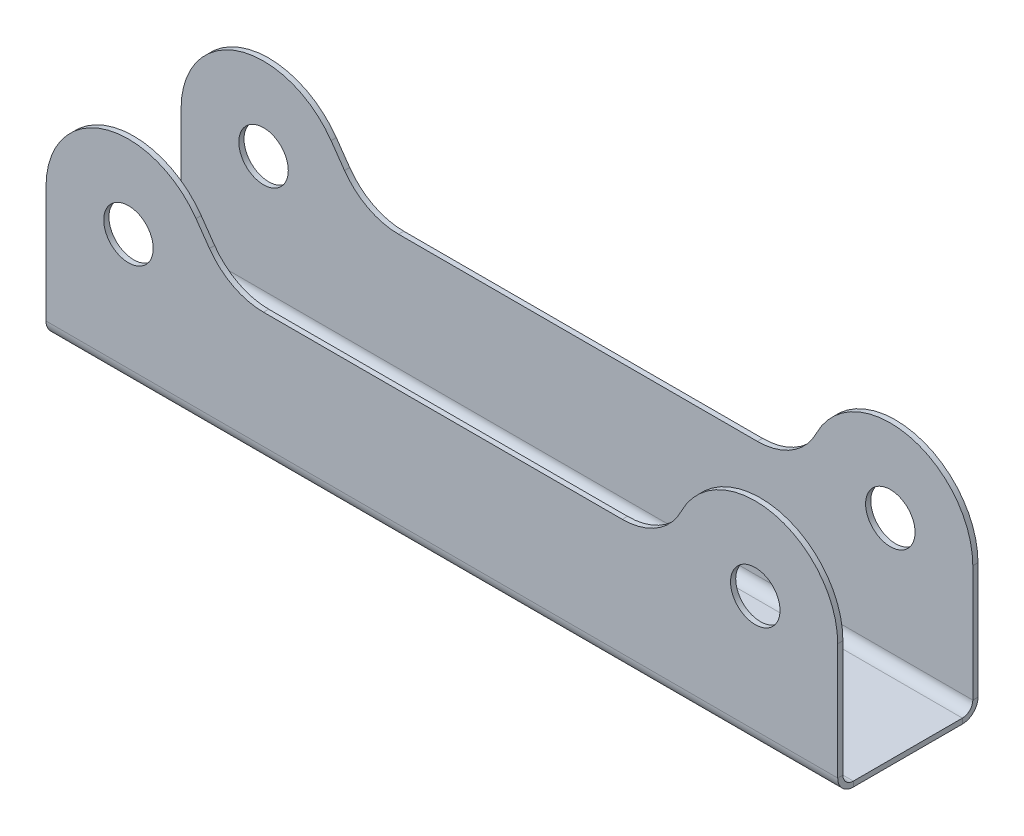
ISO-10303-21;
HEADER;
FILE_DESCRIPTION(('STEP AP214'),'2;1');
FILE_NAME('part.step','',(''),(''),'','','');
FILE_SCHEMA(('AUTOMOTIVE_DESIGN { 1 0 10303 214 1 1 1 1 }'));
ENDSEC;
DATA;
#1=APPLICATION_CONTEXT('core data for automotive mechanical design processes');
#2=APPLICATION_PROTOCOL_DEFINITION('international standard','automotive_design',2000,#1);
#3=PRODUCT_CONTEXT('',#1,'mechanical');
#4=PRODUCT('Part','Part','',(#3));
#5=PRODUCT_RELATED_PRODUCT_CATEGORY('part','',(#4));
#6=PRODUCT_DEFINITION_FORMATION('','',#4);
#7=PRODUCT_DEFINITION_CONTEXT('part definition',#1,'design');
#8=PRODUCT_DEFINITION('design','',#6,#7);
#9=PRODUCT_DEFINITION_SHAPE('','',#8);
#10=(LENGTH_UNIT() NAMED_UNIT(*) SI_UNIT(.MILLI.,.METRE.));
#11=(NAMED_UNIT(*) PLANE_ANGLE_UNIT() SI_UNIT($,.RADIAN.));
#12=(NAMED_UNIT(*) SI_UNIT($,.STERADIAN.) SOLID_ANGLE_UNIT());
#13=UNCERTAINTY_MEASURE_WITH_UNIT(LENGTH_MEASURE(1.E-05),#10,'distance_accuracy_value','');
#14=(GEOMETRIC_REPRESENTATION_CONTEXT(3) GLOBAL_UNCERTAINTY_ASSIGNED_CONTEXT((#13)) GLOBAL_UNIT_ASSIGNED_CONTEXT((#10,
#11,#12)) REPRESENTATION_CONTEXT('',''));
#15=CARTESIAN_POINT('',(0.,0.,0.));
#16=DIRECTION('',(0.,0.,1.));
#17=DIRECTION('',(1.,0.,0.));
#18=AXIS2_PLACEMENT_3D('',#15,#16,#17);
#19=CARTESIAN_POINT('',(120.65,0.,-13.5));
#20=DIRECTION('',(0.,0.,1.));
#21=DIRECTION('',(1.,0.,0.));
#22=AXIS2_PLACEMENT_3D('',#19,#20,#21);
#23=CYLINDRICAL_SURFACE('',#22,4.76250000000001);
#24=CARTESIAN_POINT('',(120.65,0.,-13.5));
#25=DIRECTION('',(0.,0.,1.));
#26=DIRECTION('',(1.,0.,0.));
#27=AXIS2_PLACEMENT_3D('',#24,#25,#26);
#28=CIRCLE('',#27,4.76250000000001);
#29=CARTESIAN_POINT('',(125.4125,0.,-13.5));
#30=VERTEX_POINT('',#29);
#31=EDGE_CURVE('E228',#30,#30,#28,.T.);
#32=ORIENTED_EDGE('',*,*,#31,.F.);
#33=EDGE_LOOP('',(#32));
#34=FACE_BOUND('',#33,.T.);
#35=CARTESIAN_POINT('',(120.65,0.,-12.5));
#36=DIRECTION('',(0.,0.,-1.));
#37=DIRECTION('',(-1.,0.,0.));
#38=AXIS2_PLACEMENT_3D('',#35,#36,#37);
#39=CIRCLE('',#38,4.76250000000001);
#40=CARTESIAN_POINT('',(115.8875,0.,-12.5));
#41=VERTEX_POINT('',#40);
#42=EDGE_CURVE('E292',#41,#41,#39,.T.);
#43=ORIENTED_EDGE('',*,*,#42,.F.);
#44=EDGE_LOOP('',(#43));
#45=FACE_BOUND('',#44,.T.);
#46=ADVANCED_FACE('F28',(#34,#45),#23,.F.);
#47=CARTESIAN_POINT('',(0.,0.,-13.5));
#48=DIRECTION('',(0.,0.,-1.));
#49=DIRECTION('',(-1.,0.,0.));
#50=AXIS2_PLACEMENT_3D('',#47,#48,#49);
#51=PLANE('',#50);
#52=DIRECTION('',(1.,0.,0.));
#53=VECTOR('',#52,1.);
#54=CARTESIAN_POINT('',(136.525,-22.4,-13.5));
#55=LINE('',#54,#53);
#56=CARTESIAN_POINT('',(-15.875,-22.4,-13.5));
#57=VERTEX_POINT('',#56);
#58=CARTESIAN_POINT('',(136.525,-22.4,-13.5));
#59=VERTEX_POINT('',#58);
#60=EDGE_CURVE('E204',#57,#59,#55,.T.);
#61=ORIENTED_EDGE('',*,*,#60,.F.);
#62=DIRECTION('',(0.,-1.,0.));
#63=VECTOR('',#62,1.);
#64=CARTESIAN_POINT('',(-15.875,0.,-13.5));
#65=LINE('',#64,#63);
#66=CARTESIAN_POINT('',(-15.875,0.,-13.5));
#67=VERTEX_POINT('',#66);
#68=EDGE_CURVE('E205',#67,#57,#65,.T.);
#69=ORIENTED_EDGE('',*,*,#68,.F.);
#70=CARTESIAN_POINT('',(0.,0.,-13.5));
#71=DIRECTION('',(0.,0.,-1.));
#72=DIRECTION('',(-1.,0.,0.));
#73=AXIS2_PLACEMENT_3D('',#70,#71,#72);
#74=CIRCLE('',#73,15.875);
#75=CARTESIAN_POINT('',(13.0040387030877,9.10552592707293,-13.5));
#76=VERTEX_POINT('',#75);
#77=EDGE_CURVE('E231',#67,#76,#74,.T.);
#78=ORIENTED_EDGE('',*,*,#77,.T.);
#79=DIRECTION('',(0.57357643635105,-0.819152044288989,0.));
#80=VECTOR('',#79,1.);
#81=CARTESIAN_POINT('',(13.0040387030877,9.10552592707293,-13.5));
#82=LINE('',#81,#80);
#83=CARTESIAN_POINT('',(15.5877671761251,5.41557925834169,-13.5));
#84=VERTEX_POINT('',#83);
#85=EDGE_CURVE('E234',#76,#84,#82,.T.);
#86=ORIENTED_EDGE('',*,*,#85,.T.);
#87=CARTESIAN_POINT('',(25.9909981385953,12.7,-13.5));
#88=DIRECTION('',(0.,0.,-1.));
#89=DIRECTION('',(-1.,0.,0.));
#90=AXIS2_PLACEMENT_3D('',#87,#88,#89);
#91=CIRCLE('',#90,12.7);
#92=CARTESIAN_POINT('',(25.9909981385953,0.,-13.5));
#93=VERTEX_POINT('',#92);
#94=EDGE_CURVE('E237',#84,#93,#91,.F.);
#95=ORIENTED_EDGE('',*,*,#94,.T.);
#96=DIRECTION('',(-1.,0.,0.));
#97=VECTOR('',#96,1.);
#98=CARTESIAN_POINT('',(103.756177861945,0.,-13.5));
#99=LINE('',#98,#97);
#100=CARTESIAN_POINT('',(95.0523316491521,0.,-13.5));
#101=VERTEX_POINT('',#100);
#102=EDGE_CURVE('E240',#101,#93,#99,.T.);
#103=ORIENTED_EDGE('',*,*,#102,.F.);
#104=CARTESIAN_POINT('',(95.0523316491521,12.7,-13.5));
#105=DIRECTION('',(0.,0.,-1.));
#106=DIRECTION('',(-1.,0.,0.));
#107=AXIS2_PLACEMENT_3D('',#104,#105,#106);
#108=CIRCLE('',#107,12.7);
#109=CARTESIAN_POINT('',(106.429073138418,7.05555555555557,-13.5));
#110=VERTEX_POINT('',#109);
#111=EDGE_CURVE('E242',#101,#110,#108,.F.);
#112=ORIENTED_EDGE('',*,*,#111,.T.);
#113=CARTESIAN_POINT('',(120.65,0.,-13.5));
#114=DIRECTION('',(0.,0.,1.));
#115=DIRECTION('',(1.,0.,0.));
#116=AXIS2_PLACEMENT_3D('',#113,#114,#115);
#117=CIRCLE('',#116,15.875);
#118=CARTESIAN_POINT('',(136.525,0.,-13.5));
#119=VERTEX_POINT('',#118);
#120=EDGE_CURVE('E49',#119,#110,#117,.T.);
#121=ORIENTED_EDGE('',*,*,#120,.F.);
#122=DIRECTION('',(0.,1.,0.));
#123=VECTOR('',#122,1.);
#124=CARTESIAN_POINT('',(136.525,-25.4,-13.5));
#125=LINE('',#124,#123);
#126=EDGE_CURVE('E42',#59,#119,#125,.T.);
#127=ORIENTED_EDGE('',*,*,#126,.F.);
#128=EDGE_LOOP('',(#61,#69,#78,#86,#95,#103,#112,#121,#127));
#129=FACE_BOUND('',#128,.T.);
#130=CARTESIAN_POINT('',(0.,0.,-13.5));
#131=DIRECTION('',(0.,0.,1.));
#132=DIRECTION('',(1.,0.,0.));
#133=AXIS2_PLACEMENT_3D('',#130,#131,#132);
#134=CIRCLE('',#133,4.7625);
#135=CARTESIAN_POINT('',(4.7625,0.,-13.5));
#136=VERTEX_POINT('',#135);
#137=EDGE_CURVE('E225',#136,#136,#134,.T.);
#138=ORIENTED_EDGE('',*,*,#137,.T.);
#139=EDGE_LOOP('',(#138));
#140=FACE_BOUND('',#139,.T.);
#141=ORIENTED_EDGE('',*,*,#31,.T.);
#142=EDGE_LOOP('',(#141));
#143=FACE_BOUND('',#142,.T.);
#144=ADVANCED_FACE('F270',(#129,#140,#143),#51,.T.);
#145=CARTESIAN_POINT('',(0.,0.,-13.5));
#146=DIRECTION('',(0.,0.,1.));
#147=DIRECTION('',(1.,0.,0.));
#148=AXIS2_PLACEMENT_3D('',#145,#146,#147);
#149=CYLINDRICAL_SURFACE('',#148,4.7625);
#150=ORIENTED_EDGE('',*,*,#137,.F.);
#151=EDGE_LOOP('',(#150));
#152=FACE_BOUND('',#151,.T.);
#153=CARTESIAN_POINT('',(0.,0.,-12.5));
#154=DIRECTION('',(0.,0.,-1.));
#155=DIRECTION('',(-1.,0.,0.));
#156=AXIS2_PLACEMENT_3D('',#153,#154,#155);
#157=CIRCLE('',#156,4.7625);
#158=CARTESIAN_POINT('',(-4.7625,0.,-12.5));
#159=VERTEX_POINT('',#158);
#160=EDGE_CURVE('E294',#159,#159,#157,.T.);
#161=ORIENTED_EDGE('',*,*,#160,.F.);
#162=EDGE_LOOP('',(#161));
#163=FACE_BOUND('',#162,.T.);
#164=ADVANCED_FACE('F510',(#152,#163),#149,.F.);
#165=CARTESIAN_POINT('',(0.,0.,-12.5));
#166=DIRECTION('',(0.,0.,-1.));
#167=DIRECTION('',(-1.,0.,0.));
#168=AXIS2_PLACEMENT_3D('',#165,#166,#167);
#169=PLANE('',#168);
#170=ORIENTED_EDGE('',*,*,#160,.T.);
#171=EDGE_LOOP('',(#170));
#172=FACE_BOUND('',#171,.T.);
#173=ORIENTED_EDGE('',*,*,#42,.T.);
#174=EDGE_LOOP('',(#173));
#175=FACE_BOUND('',#174,.T.);
#176=DIRECTION('',(0.,-1.,0.));
#177=VECTOR('',#176,1.);
#178=CARTESIAN_POINT('',(-15.875,0.,-12.5));
#179=LINE('',#178,#177);
#180=CARTESIAN_POINT('',(-15.875,0.,-12.5));
#181=VERTEX_POINT('',#180);
#182=CARTESIAN_POINT('',(-15.875,-22.4,-12.5));
#183=VERTEX_POINT('',#182);
#184=EDGE_CURVE('E202',#181,#183,#179,.T.);
#185=ORIENTED_EDGE('',*,*,#184,.T.);
#186=DIRECTION('',(1.,0.,0.));
#187=VECTOR('',#186,1.);
#188=CARTESIAN_POINT('',(136.525,-22.4,-12.5));
#189=LINE('',#188,#187);
#190=CARTESIAN_POINT('',(136.525,-22.4,-12.5));
#191=VERTEX_POINT('',#190);
#192=EDGE_CURVE('E189',#183,#191,#189,.T.);
#193=ORIENTED_EDGE('',*,*,#192,.T.);
#194=DIRECTION('',(0.,1.,0.));
#195=VECTOR('',#194,1.);
#196=CARTESIAN_POINT('',(136.525,0.,-12.5));
#197=LINE('',#196,#195);
#198=CARTESIAN_POINT('',(136.525,0.,-12.5));
#199=VERTEX_POINT('',#198);
#200=EDGE_CURVE('E199',#191,#199,#197,.T.);
#201=ORIENTED_EDGE('',*,*,#200,.T.);
#202=CARTESIAN_POINT('',(120.65,0.,-12.5));
#203=DIRECTION('',(0.,0.,-1.));
#204=DIRECTION('',(-1.,0.,0.));
#205=AXIS2_PLACEMENT_3D('',#202,#203,#204);
#206=CIRCLE('',#205,15.875);
#207=CARTESIAN_POINT('',(106.429073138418,7.05555555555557,-12.5));
#208=VERTEX_POINT('',#207);
#209=EDGE_CURVE('E207',#199,#208,#206,.F.);
#210=ORIENTED_EDGE('',*,*,#209,.T.);
#211=CARTESIAN_POINT('',(95.0523316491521,12.7,-12.5));
#212=DIRECTION('',(0.,0.,-1.));
#213=DIRECTION('',(-1.,0.,0.));
#214=AXIS2_PLACEMENT_3D('',#211,#212,#213);
#215=CIRCLE('',#214,12.7);
#216=CARTESIAN_POINT('',(95.0523316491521,0.,-12.5));
#217=VERTEX_POINT('',#216);
#218=EDGE_CURVE('E209',#217,#208,#215,.F.);
#219=ORIENTED_EDGE('',*,*,#218,.F.);
#220=DIRECTION('',(-1.,0.,0.));
#221=VECTOR('',#220,1.);
#222=CARTESIAN_POINT('',(0.,0.,-12.5));
#223=LINE('',#222,#221);
#224=CARTESIAN_POINT('',(25.9909981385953,0.,-12.5));
#225=VERTEX_POINT('',#224);
#226=EDGE_CURVE('E217',#217,#225,#223,.T.);
#227=ORIENTED_EDGE('',*,*,#226,.T.);
#228=CARTESIAN_POINT('',(25.9909981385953,12.7,-12.5));
#229=DIRECTION('',(0.,0.,-1.));
#230=DIRECTION('',(-1.,0.,0.));
#231=AXIS2_PLACEMENT_3D('',#228,#229,#230);
#232=CIRCLE('',#231,12.7);
#233=CARTESIAN_POINT('',(15.5877671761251,5.41557925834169,-12.5));
#234=VERTEX_POINT('',#233);
#235=EDGE_CURVE('E219',#234,#225,#232,.F.);
#236=ORIENTED_EDGE('',*,*,#235,.F.);
#237=DIRECTION('',(0.57357643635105,-0.819152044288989,0.));
#238=VECTOR('',#237,1.);
#239=CARTESIAN_POINT('',(13.0040387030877,9.10552592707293,-12.5));
#240=LINE('',#239,#238);
#241=CARTESIAN_POINT('',(13.0040387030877,9.10552592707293,-12.5));
#242=VERTEX_POINT('',#241);
#243=EDGE_CURVE('E222',#242,#234,#240,.T.);
#244=ORIENTED_EDGE('',*,*,#243,.F.);
#245=CARTESIAN_POINT('',(0.,0.,-12.5));
#246=DIRECTION('',(0.,0.,-1.));
#247=DIRECTION('',(-1.,0.,0.));
#248=AXIS2_PLACEMENT_3D('',#245,#246,#247);
#249=CIRCLE('',#248,15.875);
#250=EDGE_CURVE('E211',#181,#242,#249,.T.);
#251=ORIENTED_EDGE('',*,*,#250,.F.);
#252=EDGE_LOOP('',(#185,#193,#201,#210,#219,#227,#236,#244,#251));
#253=FACE_BOUND('',#252,.T.);
#254=ADVANCED_FACE('F198',(#172,#175,#253),#169,.F.);
#255=CARTESIAN_POINT('',(136.525,0.,301.765719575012));
#256=DIRECTION('',(-1.,0.,0.));
#257=DIRECTION('',(0.,-1.,0.));
#258=AXIS2_PLACEMENT_3D('',#255,#256,#257);
#259=PLANE('',#258);
#260=ORIENTED_EDGE('',*,*,#126,.T.);
#261=DIRECTION('',(0.,0.,-1.));
#262=VECTOR('',#261,1.);
#263=CARTESIAN_POINT('',(136.525,0.,301.765719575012));
#264=LINE('',#263,#262);
#265=EDGE_CURVE('E36',#199,#119,#264,.T.);
#266=ORIENTED_EDGE('',*,*,#265,.F.);
#267=ORIENTED_EDGE('',*,*,#200,.F.);
#268=DIRECTION('',(0.,0.,-1.));
#269=VECTOR('',#268,1.);
#270=CARTESIAN_POINT('',(136.525,-22.4,301.765719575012));
#271=LINE('',#270,#269);
#272=EDGE_CURVE('E11',#191,#59,#271,.T.);
#273=ORIENTED_EDGE('',*,*,#272,.T.);
#274=EDGE_LOOP('',(#260,#266,#267,#273));
#275=FACE_BOUND('',#274,.T.);
#276=ADVANCED_FACE('F30',(#275),#259,.F.);
#277=CARTESIAN_POINT('',(120.65,0.,301.765719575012));
#278=DIRECTION('',(0.,0.,-1.));
#279=DIRECTION('',(0.,1.,0.));
#280=AXIS2_PLACEMENT_3D('',#277,#278,#279);
#281=CYLINDRICAL_SURFACE('',#280,15.875);
#282=ORIENTED_EDGE('',*,*,#120,.T.);
#283=DIRECTION('',(0.,0.,-1.));
#284=VECTOR('',#283,1.);
#285=CARTESIAN_POINT('',(106.429073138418,7.05555555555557,301.765719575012));
#286=LINE('',#285,#284);
#287=EDGE_CURVE('E266',#208,#110,#286,.T.);
#288=ORIENTED_EDGE('',*,*,#287,.F.);
#289=ORIENTED_EDGE('',*,*,#209,.F.);
#290=ORIENTED_EDGE('',*,*,#265,.T.);
#291=EDGE_LOOP('',(#282,#288,#289,#290));
#292=FACE_BOUND('',#291,.T.);
#293=ADVANCED_FACE('F267',(#292),#281,.T.);
#294=CARTESIAN_POINT('',(95.0523316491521,12.7,301.765719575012));
#295=DIRECTION('',(0.,0.,-1.));
#296=DIRECTION('',(0.,1.,0.));
#297=AXIS2_PLACEMENT_3D('',#294,#295,#296);
#298=CYLINDRICAL_SURFACE('',#297,12.7);
#299=ORIENTED_EDGE('',*,*,#287,.T.);
#300=ORIENTED_EDGE('',*,*,#111,.F.);
#301=DIRECTION('',(0.,0.,-1.));
#302=VECTOR('',#301,1.);
#303=CARTESIAN_POINT('',(95.0523316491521,0.,301.765719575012));
#304=LINE('',#303,#302);
#305=EDGE_CURVE('E263',#217,#101,#304,.T.);
#306=ORIENTED_EDGE('',*,*,#305,.F.);
#307=ORIENTED_EDGE('',*,*,#218,.T.);
#308=EDGE_LOOP('',(#299,#300,#306,#307));
#309=FACE_BOUND('',#308,.T.);
#310=ADVANCED_FACE('F275',(#309),#298,.F.);
#311=CARTESIAN_POINT('',(0.,0.,301.765719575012));
#312=DIRECTION('',(0.,-1.,0.));
#313=DIRECTION('',(1.,0.,0.));
#314=AXIS2_PLACEMENT_3D('',#311,#312,#313);
#315=PLANE('',#314);
#316=ORIENTED_EDGE('',*,*,#102,.T.);
#317=DIRECTION('',(0.,0.,-1.));
#318=VECTOR('',#317,1.);
#319=CARTESIAN_POINT('',(25.9909981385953,0.,301.765719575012));
#320=LINE('',#319,#318);
#321=EDGE_CURVE('E260',#225,#93,#320,.T.);
#322=ORIENTED_EDGE('',*,*,#321,.F.);
#323=ORIENTED_EDGE('',*,*,#226,.F.);
#324=ORIENTED_EDGE('',*,*,#305,.T.);
#325=EDGE_LOOP('',(#316,#322,#323,#324));
#326=FACE_BOUND('',#325,.T.);
#327=ADVANCED_FACE('F278',(#326),#315,.F.);
#328=CARTESIAN_POINT('',(25.9909981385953,12.7,301.765719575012));
#329=DIRECTION('',(0.,0.,-1.));
#330=DIRECTION('',(0.,1.,0.));
#331=AXIS2_PLACEMENT_3D('',#328,#329,#330);
#332=CYLINDRICAL_SURFACE('',#331,12.7);
#333=ORIENTED_EDGE('',*,*,#321,.T.);
#334=ORIENTED_EDGE('',*,*,#94,.F.);
#335=DIRECTION('',(0.,0.,-1.));
#336=VECTOR('',#335,1.);
#337=CARTESIAN_POINT('',(15.5877671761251,5.41557925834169,301.765719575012));
#338=LINE('',#337,#336);
#339=EDGE_CURVE('E257',#234,#84,#338,.T.);
#340=ORIENTED_EDGE('',*,*,#339,.F.);
#341=ORIENTED_EDGE('',*,*,#235,.T.);
#342=EDGE_LOOP('',(#333,#334,#340,#341));
#343=FACE_BOUND('',#342,.T.);
#344=ADVANCED_FACE('F282',(#343),#332,.F.);
#345=CARTESIAN_POINT('',(13.0040387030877,9.10552592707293,301.765719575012));
#346=DIRECTION('',(0.819152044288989,0.57357643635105,0.));
#347=DIRECTION('',(-0.57357643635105,0.819152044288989,0.));
#348=AXIS2_PLACEMENT_3D('',#345,#346,#347);
#349=PLANE('',#348);
#350=ORIENTED_EDGE('',*,*,#339,.T.);
#351=ORIENTED_EDGE('',*,*,#85,.F.);
#352=DIRECTION('',(0.,0.,-1.));
#353=VECTOR('',#352,1.);
#354=CARTESIAN_POINT('',(13.0040387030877,9.10552592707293,301.765719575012));
#355=LINE('',#354,#353);
#356=EDGE_CURVE('E254',#242,#76,#355,.T.);
#357=ORIENTED_EDGE('',*,*,#356,.F.);
#358=ORIENTED_EDGE('',*,*,#243,.T.);
#359=EDGE_LOOP('',(#350,#351,#357,#358));
#360=FACE_BOUND('',#359,.T.);
#361=ADVANCED_FACE('F284',(#360),#349,.T.);
#362=CARTESIAN_POINT('',(0.,0.,301.765719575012));
#363=DIRECTION('',(0.,0.,-1.));
#364=DIRECTION('',(0.,1.,0.));
#365=AXIS2_PLACEMENT_3D('',#362,#363,#364);
#366=CYLINDRICAL_SURFACE('',#365,15.875);
#367=ORIENTED_EDGE('',*,*,#356,.T.);
#368=ORIENTED_EDGE('',*,*,#77,.F.);
#369=DIRECTION('',(0.,0.,-1.));
#370=VECTOR('',#369,1.);
#371=CARTESIAN_POINT('',(-15.875,0.,301.765719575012));
#372=LINE('',#371,#370);
#373=EDGE_CURVE('E252',#181,#67,#372,.T.);
#374=ORIENTED_EDGE('',*,*,#373,.F.);
#375=ORIENTED_EDGE('',*,*,#250,.T.);
#376=EDGE_LOOP('',(#367,#368,#374,#375));
#377=FACE_BOUND('',#376,.T.);
#378=ADVANCED_FACE('F290',(#377),#366,.T.);
#379=CARTESIAN_POINT('',(-15.875,0.,301.765719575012));
#380=DIRECTION('',(1.,0.,0.));
#381=DIRECTION('',(0.,1.,0.));
#382=AXIS2_PLACEMENT_3D('',#379,#380,#381);
#383=PLANE('',#382);
#384=ORIENTED_EDGE('',*,*,#68,.T.);
#385=DIRECTION('',(0.,0.,-1.));
#386=VECTOR('',#385,1.);
#387=CARTESIAN_POINT('',(-15.875,-22.4,301.765719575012));
#388=LINE('',#387,#386);
#389=EDGE_CURVE('E250',#183,#57,#388,.T.);
#390=ORIENTED_EDGE('',*,*,#389,.F.);
#391=ORIENTED_EDGE('',*,*,#184,.F.);
#392=ORIENTED_EDGE('',*,*,#373,.T.);
#393=EDGE_LOOP('',(#384,#390,#391,#392));
#394=FACE_BOUND('',#393,.T.);
#395=ADVANCED_FACE('F526',(#394),#383,.F.);
#396=CARTESIAN_POINT('',(120.65,0.,-13.5));
#397=DIRECTION('',(0.,0.,1.));
#398=DIRECTION('',(1.,0.,0.));
#399=AXIS2_PLACEMENT_3D('',#396,#397,#398);
#400=CYLINDRICAL_SURFACE('',#399,4.76250000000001);
#401=CARTESIAN_POINT('',(120.65,0.,12.5));
#402=DIRECTION('',(0.,0.,-1.));
#403=DIRECTION('',(-1.,0.,0.));
#404=AXIS2_PLACEMENT_3D('',#401,#402,#403);
#405=CIRCLE('',#404,4.76250000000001);
#406=CARTESIAN_POINT('',(115.8875,0.,12.5));
#407=VERTEX_POINT('',#406);
#408=EDGE_CURVE('E379',#407,#407,#405,.T.);
#409=ORIENTED_EDGE('',*,*,#408,.T.);
#410=EDGE_LOOP('',(#409));
#411=FACE_BOUND('',#410,.T.);
#412=CARTESIAN_POINT('',(120.65,0.,13.5));
#413=DIRECTION('',(0.,0.,1.));
#414=DIRECTION('',(1.,0.,0.));
#415=AXIS2_PLACEMENT_3D('',#412,#413,#414);
#416=CIRCLE('',#415,4.76250000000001);
#417=CARTESIAN_POINT('',(125.4125,0.,13.5));
#418=VERTEX_POINT('',#417);
#419=EDGE_CURVE('E354',#418,#418,#416,.T.);
#420=ORIENTED_EDGE('',*,*,#419,.T.);
#421=EDGE_LOOP('',(#420));
#422=FACE_BOUND('',#421,.T.);
#423=ADVANCED_FACE('F508',(#411,#422),#400,.F.);
#424=CARTESIAN_POINT('',(0.,0.,13.5));
#425=DIRECTION('',(0.,0.,-1.));
#426=DIRECTION('',(-1.,0.,0.));
#427=AXIS2_PLACEMENT_3D('',#424,#425,#426);
#428=PLANE('',#427);
#429=CARTESIAN_POINT('',(0.,0.,13.5));
#430=DIRECTION('',(0.,0.,1.));
#431=DIRECTION('',(1.,0.,0.));
#432=AXIS2_PLACEMENT_3D('',#429,#430,#431);
#433=CIRCLE('',#432,4.7625);
#434=CARTESIAN_POINT('',(4.7625,0.,13.5));
#435=VERTEX_POINT('',#434);
#436=EDGE_CURVE('E357',#435,#435,#433,.T.);
#437=ORIENTED_EDGE('',*,*,#436,.F.);
#438=EDGE_LOOP('',(#437));
#439=FACE_BOUND('',#438,.T.);
#440=ORIENTED_EDGE('',*,*,#419,.F.);
#441=EDGE_LOOP('',(#440));
#442=FACE_BOUND('',#441,.T.);
#443=DIRECTION('',(0.,-1.,0.));
#444=VECTOR('',#443,1.);
#445=CARTESIAN_POINT('',(-15.875,0.,13.5));
#446=LINE('',#445,#444);
#447=CARTESIAN_POINT('',(-15.875,0.,13.5));
#448=VERTEX_POINT('',#447);
#449=CARTESIAN_POINT('',(-15.875,-22.4,13.5));
#450=VERTEX_POINT('',#449);
#451=EDGE_CURVE('E349',#448,#450,#446,.T.);
#452=ORIENTED_EDGE('',*,*,#451,.T.);
#453=DIRECTION('',(1.,0.,0.));
#454=VECTOR('',#453,1.);
#455=CARTESIAN_POINT('',(-15.875,-22.4,13.5));
#456=LINE('',#455,#454);
#457=CARTESIAN_POINT('',(136.525,-22.4,13.5));
#458=VERTEX_POINT('',#457);
#459=EDGE_CURVE('E330',#450,#458,#456,.T.);
#460=ORIENTED_EDGE('',*,*,#459,.T.);
#461=DIRECTION('',(0.,1.,0.));
#462=VECTOR('',#461,1.);
#463=CARTESIAN_POINT('',(136.525,0.,13.5));
#464=LINE('',#463,#462);
#465=CARTESIAN_POINT('',(136.525,0.,13.5));
#466=VERTEX_POINT('',#465);
#467=EDGE_CURVE('E299',#458,#466,#464,.T.);
#468=ORIENTED_EDGE('',*,*,#467,.T.);
#469=CARTESIAN_POINT('',(120.65,0.,13.5));
#470=DIRECTION('',(0.,0.,1.));
#471=DIRECTION('',(1.,0.,0.));
#472=AXIS2_PLACEMENT_3D('',#469,#470,#471);
#473=CIRCLE('',#472,15.875);
#474=CARTESIAN_POINT('',(106.429073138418,7.05555555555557,13.5));
#475=VERTEX_POINT('',#474);
#476=EDGE_CURVE('E346',#466,#475,#473,.T.);
#477=ORIENTED_EDGE('',*,*,#476,.T.);
#478=CARTESIAN_POINT('',(95.0523316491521,12.7,13.5));
#479=DIRECTION('',(0.,0.,-1.));
#480=DIRECTION('',(-1.,0.,0.));
#481=AXIS2_PLACEMENT_3D('',#478,#479,#480);
#482=CIRCLE('',#481,12.7);
#483=CARTESIAN_POINT('',(95.0523316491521,0.,13.5));
#484=VERTEX_POINT('',#483);
#485=EDGE_CURVE('E343',#475,#484,#482,.T.);
#486=ORIENTED_EDGE('',*,*,#485,.T.);
#487=DIRECTION('',(-1.,0.,0.));
#488=VECTOR('',#487,1.);
#489=CARTESIAN_POINT('',(103.756177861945,0.,13.5));
#490=LINE('',#489,#488);
#491=CARTESIAN_POINT('',(25.9909981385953,0.,13.5));
#492=VERTEX_POINT('',#491);
#493=EDGE_CURVE('E340',#484,#492,#490,.T.);
#494=ORIENTED_EDGE('',*,*,#493,.T.);
#495=CARTESIAN_POINT('',(25.9909981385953,12.7,13.5));
#496=DIRECTION('',(0.,0.,-1.));
#497=DIRECTION('',(-1.,0.,0.));
#498=AXIS2_PLACEMENT_3D('',#495,#496,#497);
#499=CIRCLE('',#498,12.7);
#500=CARTESIAN_POINT('',(15.5877671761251,5.41557925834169,13.5));
#501=VERTEX_POINT('',#500);
#502=EDGE_CURVE('E337',#492,#501,#499,.T.);
#503=ORIENTED_EDGE('',*,*,#502,.T.);
#504=DIRECTION('',(0.57357643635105,-0.819152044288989,0.));
#505=VECTOR('',#504,1.);
#506=CARTESIAN_POINT('',(13.0040387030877,9.10552592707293,13.5));
#507=LINE('',#506,#505);
#508=CARTESIAN_POINT('',(13.0040387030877,9.10552592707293,13.5));
#509=VERTEX_POINT('',#508);
#510=EDGE_CURVE('E335',#509,#501,#507,.T.);
#511=ORIENTED_EDGE('',*,*,#510,.F.);
#512=CARTESIAN_POINT('',(0.,0.,13.5));
#513=DIRECTION('',(0.,0.,-1.));
#514=DIRECTION('',(-1.,0.,0.));
#515=AXIS2_PLACEMENT_3D('',#512,#513,#514);
#516=CIRCLE('',#515,15.875);
#517=EDGE_CURVE('E352',#448,#509,#516,.T.);
#518=ORIENTED_EDGE('',*,*,#517,.F.);
#519=EDGE_LOOP('',(#452,#460,#468,#477,#486,#494,#503,#511,#518));
#520=FACE_BOUND('',#519,.T.);
#521=ADVANCED_FACE('F466',(#439,#442,#520),#428,.F.);
#522=CARTESIAN_POINT('',(0.,0.,-13.5));
#523=DIRECTION('',(0.,0.,1.));
#524=DIRECTION('',(1.,0.,0.));
#525=AXIS2_PLACEMENT_3D('',#522,#523,#524);
#526=CYLINDRICAL_SURFACE('',#525,4.7625);
#527=CARTESIAN_POINT('',(0.,0.,12.5));
#528=DIRECTION('',(0.,0.,-1.));
#529=DIRECTION('',(-1.,0.,0.));
#530=AXIS2_PLACEMENT_3D('',#527,#528,#529);
#531=CIRCLE('',#530,4.7625);
#532=CARTESIAN_POINT('',(-4.7625,0.,12.5));
#533=VERTEX_POINT('',#532);
#534=EDGE_CURVE('E382',#533,#533,#531,.T.);
#535=ORIENTED_EDGE('',*,*,#534,.T.);
#536=EDGE_LOOP('',(#535));
#537=FACE_BOUND('',#536,.T.);
#538=ORIENTED_EDGE('',*,*,#436,.T.);
#539=EDGE_LOOP('',(#538));
#540=FACE_BOUND('',#539,.T.);
#541=ADVANCED_FACE('F582',(#537,#540),#526,.F.);
#542=CARTESIAN_POINT('',(0.,0.,12.5));
#543=DIRECTION('',(0.,0.,-1.));
#544=DIRECTION('',(-1.,0.,0.));
#545=AXIS2_PLACEMENT_3D('',#542,#543,#544);
#546=PLANE('',#545);
#547=DIRECTION('',(1.,0.,0.));
#548=VECTOR('',#547,1.);
#549=CARTESIAN_POINT('',(-15.875,-22.4,12.5));
#550=LINE('',#549,#548);
#551=CARTESIAN_POINT('',(-15.875,-22.4,12.5));
#552=VERTEX_POINT('',#551);
#553=CARTESIAN_POINT('',(136.525,-22.4,12.5));
#554=VERTEX_POINT('',#553);
#555=EDGE_CURVE('E333',#552,#554,#550,.T.);
#556=ORIENTED_EDGE('',*,*,#555,.F.);
#557=DIRECTION('',(0.,-1.,0.));
#558=VECTOR('',#557,1.);
#559=CARTESIAN_POINT('',(-15.875,0.,12.5));
#560=LINE('',#559,#558);
#561=CARTESIAN_POINT('',(-15.875,0.,12.5));
#562=VERTEX_POINT('',#561);
#563=EDGE_CURVE('E360',#562,#552,#560,.T.);
#564=ORIENTED_EDGE('',*,*,#563,.F.);
#565=CARTESIAN_POINT('',(0.,0.,12.5));
#566=DIRECTION('',(0.,0.,-1.));
#567=DIRECTION('',(-1.,0.,0.));
#568=AXIS2_PLACEMENT_3D('',#565,#566,#567);
#569=CIRCLE('',#568,15.875);
#570=CARTESIAN_POINT('',(13.0040387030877,9.10552592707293,12.5));
#571=VERTEX_POINT('',#570);
#572=EDGE_CURVE('E377',#562,#571,#569,.T.);
#573=ORIENTED_EDGE('',*,*,#572,.T.);
#574=DIRECTION('',(0.57357643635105,-0.819152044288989,0.));
#575=VECTOR('',#574,1.);
#576=CARTESIAN_POINT('',(13.0040387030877,9.10552592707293,12.5));
#577=LINE('',#576,#575);
#578=CARTESIAN_POINT('',(15.5877671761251,5.41557925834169,12.5));
#579=VERTEX_POINT('',#578);
#580=EDGE_CURVE('E375',#571,#579,#577,.T.);
#581=ORIENTED_EDGE('',*,*,#580,.T.);
#582=CARTESIAN_POINT('',(25.9909981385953,12.7,12.5));
#583=DIRECTION('',(0.,0.,-1.));
#584=DIRECTION('',(-1.,0.,0.));
#585=AXIS2_PLACEMENT_3D('',#582,#583,#584);
#586=CIRCLE('',#585,12.7);
#587=CARTESIAN_POINT('',(25.9909981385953,0.,12.5));
#588=VERTEX_POINT('',#587);
#589=EDGE_CURVE('E372',#588,#579,#586,.T.);
#590=ORIENTED_EDGE('',*,*,#589,.F.);
#591=DIRECTION('',(-1.,0.,0.));
#592=VECTOR('',#591,1.);
#593=CARTESIAN_POINT('',(0.,0.,12.5));
#594=LINE('',#593,#592);
#595=CARTESIAN_POINT('',(95.0523316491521,0.,12.5));
#596=VERTEX_POINT('',#595);
#597=EDGE_CURVE('E369',#596,#588,#594,.T.);
#598=ORIENTED_EDGE('',*,*,#597,.F.);
#599=CARTESIAN_POINT('',(95.0523316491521,12.7,12.5));
#600=DIRECTION('',(0.,0.,-1.));
#601=DIRECTION('',(-1.,0.,0.));
#602=AXIS2_PLACEMENT_3D('',#599,#600,#601);
#603=CIRCLE('',#602,12.7);
#604=CARTESIAN_POINT('',(106.429073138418,7.05555555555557,12.5));
#605=VERTEX_POINT('',#604);
#606=EDGE_CURVE('E366',#605,#596,#603,.T.);
#607=ORIENTED_EDGE('',*,*,#606,.F.);
#608=CARTESIAN_POINT('',(120.65,0.,12.5));
#609=DIRECTION('',(0.,0.,-1.));
#610=DIRECTION('',(-1.,0.,0.));
#611=AXIS2_PLACEMENT_3D('',#608,#609,#610);
#612=CIRCLE('',#611,15.875);
#613=CARTESIAN_POINT('',(136.525,0.,12.5));
#614=VERTEX_POINT('',#613);
#615=EDGE_CURVE('E363',#614,#605,#612,.F.);
#616=ORIENTED_EDGE('',*,*,#615,.F.);
#617=DIRECTION('',(0.,1.,0.));
#618=VECTOR('',#617,1.);
#619=CARTESIAN_POINT('',(136.525,0.,12.5));
#620=LINE('',#619,#618);
#621=EDGE_CURVE('E302',#554,#614,#620,.T.);
#622=ORIENTED_EDGE('',*,*,#621,.F.);
#623=EDGE_LOOP('',(#556,#564,#573,#581,#590,#598,#607,#616,#622));
#624=FACE_BOUND('',#623,.T.);
#625=ORIENTED_EDGE('',*,*,#534,.F.);
#626=EDGE_LOOP('',(#625));
#627=FACE_BOUND('',#626,.T.);
#628=ORIENTED_EDGE('',*,*,#408,.F.);
#629=EDGE_LOOP('',(#628));
#630=FACE_BOUND('',#629,.T.);
#631=ADVANCED_FACE('F478',(#624,#627,#630),#546,.T.);
#632=CARTESIAN_POINT('',(-15.875,0.,-301.765719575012));
#633=DIRECTION('',(-1.,0.,0.));
#634=DIRECTION('',(0.,1.,0.));
#635=AXIS2_PLACEMENT_3D('',#632,#633,#634);
#636=PLANE('',#635);
#637=ORIENTED_EDGE('',*,*,#451,.F.);
#638=DIRECTION('',(0.,0.,1.));
#639=VECTOR('',#638,1.);
#640=CARTESIAN_POINT('',(-15.875,0.,-301.765719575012));
#641=LINE('',#640,#639);
#642=EDGE_CURVE('E308',#562,#448,#641,.T.);
#643=ORIENTED_EDGE('',*,*,#642,.F.);
#644=ORIENTED_EDGE('',*,*,#563,.T.);
#645=DIRECTION('',(0.,0.,1.));
#646=VECTOR('',#645,1.);
#647=CARTESIAN_POINT('',(-15.875,-22.4,-301.765719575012));
#648=LINE('',#647,#646);
#649=EDGE_CURVE('E305',#552,#450,#648,.T.);
#650=ORIENTED_EDGE('',*,*,#649,.T.);
#651=EDGE_LOOP('',(#637,#643,#644,#650));
#652=FACE_BOUND('',#651,.T.);
#653=ADVANCED_FACE('F469',(#652),#636,.T.);
#654=CARTESIAN_POINT('',(0.,0.,-301.765719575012));
#655=DIRECTION('',(0.,0.,1.));
#656=DIRECTION('',(0.,-1.,0.));
#657=AXIS2_PLACEMENT_3D('',#654,#655,#656);
#658=CYLINDRICAL_SURFACE('',#657,15.875);
#659=ORIENTED_EDGE('',*,*,#642,.T.);
#660=ORIENTED_EDGE('',*,*,#517,.T.);
#661=DIRECTION('',(0.,0.,1.));
#662=VECTOR('',#661,1.);
#663=CARTESIAN_POINT('',(13.0040387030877,9.10552592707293,-301.765719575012));
#664=LINE('',#663,#662);
#665=EDGE_CURVE('E311',#571,#509,#664,.T.);
#666=ORIENTED_EDGE('',*,*,#665,.F.);
#667=ORIENTED_EDGE('',*,*,#572,.F.);
#668=EDGE_LOOP('',(#659,#660,#666,#667));
#669=FACE_BOUND('',#668,.T.);
#670=ADVANCED_FACE('F499',(#669),#658,.T.);
#671=CARTESIAN_POINT('',(13.0040387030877,9.10552592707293,-301.765719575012));
#672=DIRECTION('',(-0.819152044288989,-0.57357643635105,0.));
#673=DIRECTION('',(-0.57357643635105,0.819152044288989,0.));
#674=AXIS2_PLACEMENT_3D('',#671,#672,#673);
#675=PLANE('',#674);
#676=ORIENTED_EDGE('',*,*,#665,.T.);
#677=ORIENTED_EDGE('',*,*,#510,.T.);
#678=DIRECTION('',(0.,0.,1.));
#679=VECTOR('',#678,1.);
#680=CARTESIAN_POINT('',(15.5877671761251,5.41557925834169,-301.765719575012));
#681=LINE('',#680,#679);
#682=EDGE_CURVE('E314',#579,#501,#681,.T.);
#683=ORIENTED_EDGE('',*,*,#682,.F.);
#684=ORIENTED_EDGE('',*,*,#580,.F.);
#685=EDGE_LOOP('',(#676,#677,#683,#684));
#686=FACE_BOUND('',#685,.T.);
#687=ADVANCED_FACE('F496',(#686),#675,.F.);
#688=CARTESIAN_POINT('',(25.9909981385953,12.7,-301.765719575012));
#689=DIRECTION('',(0.,0.,1.));
#690=DIRECTION('',(0.,-1.,0.));
#691=AXIS2_PLACEMENT_3D('',#688,#689,#690);
#692=CYLINDRICAL_SURFACE('',#691,12.7);
#693=ORIENTED_EDGE('',*,*,#502,.F.);
#694=DIRECTION('',(0.,0.,1.));
#695=VECTOR('',#694,1.);
#696=CARTESIAN_POINT('',(25.9909981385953,0.,-301.765719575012));
#697=LINE('',#696,#695);
#698=EDGE_CURVE('E317',#588,#492,#697,.T.);
#699=ORIENTED_EDGE('',*,*,#698,.F.);
#700=ORIENTED_EDGE('',*,*,#589,.T.);
#701=ORIENTED_EDGE('',*,*,#682,.T.);
#702=EDGE_LOOP('',(#693,#699,#700,#701));
#703=FACE_BOUND('',#702,.T.);
#704=ADVANCED_FACE('F492',(#703),#692,.F.);
#705=CARTESIAN_POINT('',(0.,0.,-301.765719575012));
#706=DIRECTION('',(0.,1.,0.));
#707=DIRECTION('',(1.,0.,0.));
#708=AXIS2_PLACEMENT_3D('',#705,#706,#707);
#709=PLANE('',#708);
#710=ORIENTED_EDGE('',*,*,#493,.F.);
#711=DIRECTION('',(0.,0.,1.));
#712=VECTOR('',#711,1.);
#713=CARTESIAN_POINT('',(95.0523316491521,0.,-301.765719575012));
#714=LINE('',#713,#712);
#715=EDGE_CURVE('E320',#596,#484,#714,.T.);
#716=ORIENTED_EDGE('',*,*,#715,.F.);
#717=ORIENTED_EDGE('',*,*,#597,.T.);
#718=ORIENTED_EDGE('',*,*,#698,.T.);
#719=EDGE_LOOP('',(#710,#716,#717,#718));
#720=FACE_BOUND('',#719,.T.);
#721=ADVANCED_FACE('F489',(#720),#709,.T.);
#722=CARTESIAN_POINT('',(95.0523316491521,12.7,-301.765719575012));
#723=DIRECTION('',(0.,0.,1.));
#724=DIRECTION('',(0.,-1.,0.));
#725=AXIS2_PLACEMENT_3D('',#722,#723,#724);
#726=CYLINDRICAL_SURFACE('',#725,12.7);
#727=ORIENTED_EDGE('',*,*,#485,.F.);
#728=DIRECTION('',(0.,0.,1.));
#729=VECTOR('',#728,1.);
#730=CARTESIAN_POINT('',(106.429073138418,7.05555555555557,-301.765719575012));
#731=LINE('',#730,#729);
#732=EDGE_CURVE('E323',#605,#475,#731,.T.);
#733=ORIENTED_EDGE('',*,*,#732,.F.);
#734=ORIENTED_EDGE('',*,*,#606,.T.);
#735=ORIENTED_EDGE('',*,*,#715,.T.);
#736=EDGE_LOOP('',(#727,#733,#734,#735));
#737=FACE_BOUND('',#736,.T.);
#738=ADVANCED_FACE('F485',(#737),#726,.F.);
#739=CARTESIAN_POINT('',(120.65,0.,-301.765719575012));
#740=DIRECTION('',(0.,0.,1.));
#741=DIRECTION('',(0.,-1.,0.));
#742=AXIS2_PLACEMENT_3D('',#739,#740,#741);
#743=CYLINDRICAL_SURFACE('',#742,15.875);
#744=ORIENTED_EDGE('',*,*,#476,.F.);
#745=DIRECTION('',(0.,0.,1.));
#746=VECTOR('',#745,1.);
#747=CARTESIAN_POINT('',(136.525,0.,-301.765719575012));
#748=LINE('',#747,#746);
#749=EDGE_CURVE('E326',#614,#466,#748,.T.);
#750=ORIENTED_EDGE('',*,*,#749,.F.);
#751=ORIENTED_EDGE('',*,*,#615,.T.);
#752=ORIENTED_EDGE('',*,*,#732,.T.);
#753=EDGE_LOOP('',(#744,#750,#751,#752));
#754=FACE_BOUND('',#753,.T.);
#755=ADVANCED_FACE('F483',(#754),#743,.T.);
#756=CARTESIAN_POINT('',(136.525,0.,-301.765719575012));
#757=DIRECTION('',(1.,0.,0.));
#758=DIRECTION('',(0.,-1.,0.));
#759=AXIS2_PLACEMENT_3D('',#756,#757,#758);
#760=PLANE('',#759);
#761=ORIENTED_EDGE('',*,*,#467,.F.);
#762=DIRECTION('',(0.,0.,1.));
#763=VECTOR('',#762,1.);
#764=CARTESIAN_POINT('',(136.525,-22.4,-301.765719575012));
#765=LINE('',#764,#763);
#766=EDGE_CURVE('E328',#554,#458,#765,.T.);
#767=ORIENTED_EDGE('',*,*,#766,.F.);
#768=ORIENTED_EDGE('',*,*,#621,.T.);
#769=ORIENTED_EDGE('',*,*,#749,.T.);
#770=EDGE_LOOP('',(#761,#767,#768,#769));
#771=FACE_BOUND('',#770,.T.);
#772=ADVANCED_FACE('F462',(#771),#760,.T.);
#773=CARTESIAN_POINT('',(136.525,283.28009360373,13.5));
#774=DIRECTION('',(-1.,0.,0.));
#775=DIRECTION('',(0.,0.,1.));
#776=AXIS2_PLACEMENT_3D('',#773,#774,#775);
#777=PLANE('',#776);
#778=DIRECTION('',(0.,-1.,0.));
#779=VECTOR('',#778,1.);
#780=CARTESIAN_POINT('',(136.525,283.28009360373,10.5));
#781=LINE('',#780,#779);
#782=CARTESIAN_POINT('',(136.525,-24.4,10.5));
#783=VERTEX_POINT('',#782);
#784=CARTESIAN_POINT('',(136.525,-25.4,10.5));
#785=VERTEX_POINT('',#784);
#786=EDGE_CURVE('E397',#783,#785,#781,.T.);
#787=ORIENTED_EDGE('',*,*,#786,.T.);
#788=DIRECTION('',(0.,0.,-1.));
#789=VECTOR('',#788,1.);
#790=CARTESIAN_POINT('',(136.525,-25.4,13.5));
#791=LINE('',#790,#789);
#792=CARTESIAN_POINT('',(136.525,-25.4,-10.5));
#793=VERTEX_POINT('',#792);
#794=EDGE_CURVE('E412',#785,#793,#791,.T.);
#795=ORIENTED_EDGE('',*,*,#794,.T.);
#796=DIRECTION('',(0.,-1.,0.));
#797=VECTOR('',#796,1.);
#798=CARTESIAN_POINT('',(136.525,283.28009360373,-10.5));
#799=LINE('',#798,#797);
#800=CARTESIAN_POINT('',(136.525,-24.4,-10.5));
#801=VERTEX_POINT('',#800);
#802=EDGE_CURVE('E390',#801,#793,#799,.T.);
#803=ORIENTED_EDGE('',*,*,#802,.F.);
#804=DIRECTION('',(0.,0.,-1.));
#805=VECTOR('',#804,1.);
#806=CARTESIAN_POINT('',(136.525,-24.4,13.5));
#807=LINE('',#806,#805);
#808=EDGE_CURVE('E401',#783,#801,#807,.T.);
#809=ORIENTED_EDGE('',*,*,#808,.F.);
#810=EDGE_LOOP('',(#787,#795,#803,#809));
#811=FACE_BOUND('',#810,.T.);
#812=ADVANCED_FACE('F443',(#811),#777,.F.);
#813=CARTESIAN_POINT('',(-15.875,283.28009360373,13.5));
#814=DIRECTION('',(-1.,0.,0.));
#815=DIRECTION('',(0.,0.,1.));
#816=AXIS2_PLACEMENT_3D('',#813,#814,#815);
#817=PLANE('',#816);
#818=DIRECTION('',(0.,0.,-1.));
#819=VECTOR('',#818,1.);
#820=CARTESIAN_POINT('',(-15.875,-25.4,13.5));
#821=LINE('',#820,#819);
#822=CARTESIAN_POINT('',(-15.875,-25.4,10.5));
#823=VERTEX_POINT('',#822);
#824=CARTESIAN_POINT('',(-15.875,-25.4,-10.5));
#825=VERTEX_POINT('',#824);
#826=EDGE_CURVE('E409',#823,#825,#821,.T.);
#827=ORIENTED_EDGE('',*,*,#826,.F.);
#828=DIRECTION('',(0.,-1.,0.));
#829=VECTOR('',#828,1.);
#830=CARTESIAN_POINT('',(-15.875,283.28009360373,10.5));
#831=LINE('',#830,#829);
#832=CARTESIAN_POINT('',(-15.875,-24.4,10.5));
#833=VERTEX_POINT('',#832);
#834=EDGE_CURVE('E395',#833,#823,#831,.T.);
#835=ORIENTED_EDGE('',*,*,#834,.F.);
#836=DIRECTION('',(0.,0.,-1.));
#837=VECTOR('',#836,1.);
#838=CARTESIAN_POINT('',(-15.875,-24.4,13.5));
#839=LINE('',#838,#837);
#840=CARTESIAN_POINT('',(-15.875,-24.4,-10.5));
#841=VERTEX_POINT('',#840);
#842=EDGE_CURVE('E404',#833,#841,#839,.T.);
#843=ORIENTED_EDGE('',*,*,#842,.T.);
#844=DIRECTION('',(0.,-1.,0.));
#845=VECTOR('',#844,1.);
#846=CARTESIAN_POINT('',(-15.875,283.28009360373,-10.5));
#847=LINE('',#846,#845);
#848=EDGE_CURVE('E392',#841,#825,#847,.T.);
#849=ORIENTED_EDGE('',*,*,#848,.T.);
#850=EDGE_LOOP('',(#827,#835,#843,#849));
#851=FACE_BOUND('',#850,.T.);
#852=ADVANCED_FACE('F437',(#851),#817,.T.);
#853=CARTESIAN_POINT('',(-15.875,-24.4,13.5));
#854=DIRECTION('',(0.,1.,0.));
#855=DIRECTION('',(0.,0.,1.));
#856=AXIS2_PLACEMENT_3D('',#853,#854,#855);
#857=PLANE('',#856);
#858=ORIENTED_EDGE('',*,*,#808,.T.);
#859=DIRECTION('',(-1.,0.,0.));
#860=VECTOR('',#859,1.);
#861=CARTESIAN_POINT('',(136.525,-24.4,-10.5));
#862=LINE('',#861,#860);
#863=EDGE_CURVE('E192',#801,#841,#862,.T.);
#864=ORIENTED_EDGE('',*,*,#863,.T.);
#865=ORIENTED_EDGE('',*,*,#842,.F.);
#866=DIRECTION('',(1.,0.,0.));
#867=VECTOR('',#866,1.);
#868=CARTESIAN_POINT('',(-15.875,-24.4,10.5));
#869=LINE('',#868,#867);
#870=EDGE_CURVE('E387',#833,#783,#869,.T.);
#871=ORIENTED_EDGE('',*,*,#870,.T.);
#872=EDGE_LOOP('',(#858,#864,#865,#871));
#873=FACE_BOUND('',#872,.T.);
#874=ADVANCED_FACE('F439',(#873),#857,.T.);
#875=CARTESIAN_POINT('',(-15.875,-25.4,13.5));
#876=DIRECTION('',(0.,1.,0.));
#877=DIRECTION('',(0.,0.,1.));
#878=AXIS2_PLACEMENT_3D('',#875,#876,#877);
#879=PLANE('',#878);
#880=DIRECTION('',(-1.,0.,0.));
#881=VECTOR('',#880,1.);
#882=CARTESIAN_POINT('',(136.525,-25.4,-10.5));
#883=LINE('',#882,#881);
#884=EDGE_CURVE('E407',#793,#825,#883,.T.);
#885=ORIENTED_EDGE('',*,*,#884,.F.);
#886=ORIENTED_EDGE('',*,*,#794,.F.);
#887=DIRECTION('',(1.,0.,0.));
#888=VECTOR('',#887,1.);
#889=CARTESIAN_POINT('',(-15.875,-25.4,10.5));
#890=LINE('',#889,#888);
#891=EDGE_CURVE('E385',#823,#785,#890,.T.);
#892=ORIENTED_EDGE('',*,*,#891,.F.);
#893=ORIENTED_EDGE('',*,*,#826,.T.);
#894=EDGE_LOOP('',(#885,#886,#892,#893));
#895=FACE_BOUND('',#894,.T.);
#896=ADVANCED_FACE('F449',(#895),#879,.F.);
#897=CARTESIAN_POINT('',(136.525,-22.4,10.5));
#898=DIRECTION('',(1.,0.,0.));
#899=DIRECTION('',(0.,0.,-1.));
#900=AXIS2_PLACEMENT_3D('',#897,#898,#899);
#901=PLANE('',#900);
#902=ORIENTED_EDGE('',*,*,#786,.F.);
#903=CARTESIAN_POINT('',(136.525,-22.4,10.5));
#904=DIRECTION('',(1.,0.,0.));
#905=DIRECTION('',(0.,0.,-1.));
#906=AXIS2_PLACEMENT_3D('',#903,#904,#905);
#907=CIRCLE('',#906,2.);
#908=EDGE_CURVE('E421',#783,#554,#907,.F.);
#909=ORIENTED_EDGE('',*,*,#908,.T.);
#910=ORIENTED_EDGE('',*,*,#766,.T.);
#911=CARTESIAN_POINT('',(136.525,-22.4,10.5));
#912=DIRECTION('',(1.,0.,0.));
#913=DIRECTION('',(0.,0.,-1.));
#914=AXIS2_PLACEMENT_3D('',#911,#912,#913);
#915=CIRCLE('',#914,3.);
#916=EDGE_CURVE('E415',#785,#458,#915,.F.);
#917=ORIENTED_EDGE('',*,*,#916,.F.);
#918=EDGE_LOOP('',(#902,#909,#910,#917));
#919=FACE_BOUND('',#918,.T.);
#920=ADVANCED_FACE('F456',(#919),#901,.T.);
#921=CARTESIAN_POINT('',(-15.875,-22.4,10.5));
#922=DIRECTION('',(-1.,0.,0.));
#923=DIRECTION('',(0.,0.,1.));
#924=AXIS2_PLACEMENT_3D('',#921,#922,#923);
#925=PLANE('',#924);
#926=ORIENTED_EDGE('',*,*,#649,.F.);
#927=CARTESIAN_POINT('',(-15.875,-22.4,10.5));
#928=DIRECTION('',(1.,0.,0.));
#929=DIRECTION('',(0.,0.,-1.));
#930=AXIS2_PLACEMENT_3D('',#927,#928,#929);
#931=CIRCLE('',#930,2.);
#932=EDGE_CURVE('E424',#552,#833,#931,.T.);
#933=ORIENTED_EDGE('',*,*,#932,.T.);
#934=ORIENTED_EDGE('',*,*,#834,.T.);
#935=CARTESIAN_POINT('',(-15.875,-22.4,10.5));
#936=DIRECTION('',(1.,0.,0.));
#937=DIRECTION('',(0.,0.,-1.));
#938=AXIS2_PLACEMENT_3D('',#935,#936,#937);
#939=CIRCLE('',#938,3.);
#940=EDGE_CURVE('E418',#450,#823,#939,.T.);
#941=ORIENTED_EDGE('',*,*,#940,.F.);
#942=EDGE_LOOP('',(#926,#933,#934,#941));
#943=FACE_BOUND('',#942,.T.);
#944=ADVANCED_FACE('F473',(#943),#925,.T.);
#945=CARTESIAN_POINT('',(-201.176806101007,-22.4,10.5));
#946=DIRECTION('',(1.,0.,0.));
#947=DIRECTION('',(0.,0.,-1.));
#948=AXIS2_PLACEMENT_3D('',#945,#946,#947);
#949=CYLINDRICAL_SURFACE('',#948,3.);
#950=ORIENTED_EDGE('',*,*,#940,.T.);
#951=ORIENTED_EDGE('',*,*,#891,.T.);
#952=ORIENTED_EDGE('',*,*,#916,.T.);
#953=ORIENTED_EDGE('',*,*,#459,.F.);
#954=EDGE_LOOP('',(#950,#951,#952,#953));
#955=FACE_BOUND('',#954,.T.);
#956=ADVANCED_FACE('F453',(#955),#949,.T.);
#957=CARTESIAN_POINT('',(-201.176806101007,-22.4,10.5));
#958=DIRECTION('',(1.,0.,0.));
#959=DIRECTION('',(0.,0.,-1.));
#960=AXIS2_PLACEMENT_3D('',#957,#958,#959);
#961=CYLINDRICAL_SURFACE('',#960,2.);
#962=ORIENTED_EDGE('',*,*,#932,.F.);
#963=ORIENTED_EDGE('',*,*,#555,.T.);
#964=ORIENTED_EDGE('',*,*,#908,.F.);
#965=ORIENTED_EDGE('',*,*,#870,.F.);
#966=EDGE_LOOP('',(#962,#963,#964,#965));
#967=FACE_BOUND('',#966,.T.);
#968=ADVANCED_FACE('F476',(#967),#961,.F.);
#969=CARTESIAN_POINT('',(-15.875,-22.4,-10.5));
#970=DIRECTION('',(-1.,0.,0.));
#971=DIRECTION('',(0.,0.,1.));
#972=AXIS2_PLACEMENT_3D('',#969,#970,#971);
#973=PLANE('',#972);
#974=ORIENTED_EDGE('',*,*,#848,.F.);
#975=CARTESIAN_POINT('',(-15.875,-22.4,-10.5));
#976=DIRECTION('',(-1.,0.,0.));
#977=DIRECTION('',(0.,0.,1.));
#978=AXIS2_PLACEMENT_3D('',#975,#976,#977);
#979=CIRCLE('',#978,2.);
#980=EDGE_CURVE('E194',#841,#183,#979,.F.);
#981=ORIENTED_EDGE('',*,*,#980,.T.);
#982=ORIENTED_EDGE('',*,*,#389,.T.);
#983=CARTESIAN_POINT('',(-15.875,-22.4,-10.5));
#984=DIRECTION('',(-1.,0.,0.));
#985=DIRECTION('',(0.,0.,1.));
#986=AXIS2_PLACEMENT_3D('',#983,#984,#985);
#987=CIRCLE('',#986,3.);
#988=EDGE_CURVE('E426',#825,#57,#987,.F.);
#989=ORIENTED_EDGE('',*,*,#988,.F.);
#990=EDGE_LOOP('',(#974,#981,#982,#989));
#991=FACE_BOUND('',#990,.T.);
#992=ADVANCED_FACE('F431',(#991),#973,.T.);
#993=CARTESIAN_POINT('',(136.525,-22.4,-10.5));
#994=DIRECTION('',(1.,0.,0.));
#995=DIRECTION('',(0.,0.,-1.));
#996=AXIS2_PLACEMENT_3D('',#993,#994,#995);
#997=PLANE('',#996);
#998=ORIENTED_EDGE('',*,*,#272,.F.);
#999=CARTESIAN_POINT('',(136.525,-22.4,-10.5));
#1000=DIRECTION('',(-1.,0.,0.));
#1001=DIRECTION('',(0.,0.,1.));
#1002=AXIS2_PLACEMENT_3D('',#999,#1000,#1001);
#1003=CIRCLE('',#1002,2.);
#1004=EDGE_CURVE('E179',#191,#801,#1003,.T.);
#1005=ORIENTED_EDGE('',*,*,#1004,.T.);
#1006=ORIENTED_EDGE('',*,*,#802,.T.);
#1007=CARTESIAN_POINT('',(136.525,-22.4,-10.5));
#1008=DIRECTION('',(-1.,0.,0.));
#1009=DIRECTION('',(0.,0.,1.));
#1010=AXIS2_PLACEMENT_3D('',#1007,#1008,#1009);
#1011=CIRCLE('',#1010,3.);
#1012=EDGE_CURVE('E182',#59,#793,#1011,.T.);
#1013=ORIENTED_EDGE('',*,*,#1012,.F.);
#1014=EDGE_LOOP('',(#998,#1005,#1006,#1013));
#1015=FACE_BOUND('',#1014,.T.);
#1016=ADVANCED_FACE('F178',(#1015),#997,.T.);
#1017=CARTESIAN_POINT('',(307.732737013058,-22.4,-10.5));
#1018=DIRECTION('',(-1.,0.,0.));
#1019=DIRECTION('',(0.,0.,1.));
#1020=AXIS2_PLACEMENT_3D('',#1017,#1018,#1019);
#1021=CYLINDRICAL_SURFACE('',#1020,3.);
#1022=ORIENTED_EDGE('',*,*,#1012,.T.);
#1023=ORIENTED_EDGE('',*,*,#884,.T.);
#1024=ORIENTED_EDGE('',*,*,#988,.T.);
#1025=ORIENTED_EDGE('',*,*,#60,.T.);
#1026=EDGE_LOOP('',(#1022,#1023,#1024,#1025));
#1027=FACE_BOUND('',#1026,.T.);
#1028=ADVANCED_FACE('F447',(#1027),#1021,.T.);
#1029=CARTESIAN_POINT('',(307.732737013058,-22.4,-10.5));
#1030=DIRECTION('',(-1.,0.,0.));
#1031=DIRECTION('',(0.,0.,1.));
#1032=AXIS2_PLACEMENT_3D('',#1029,#1030,#1031);
#1033=CYLINDRICAL_SURFACE('',#1032,2.);
#1034=ORIENTED_EDGE('',*,*,#1004,.F.);
#1035=ORIENTED_EDGE('',*,*,#192,.F.);
#1036=ORIENTED_EDGE('',*,*,#980,.F.);
#1037=ORIENTED_EDGE('',*,*,#863,.F.);
#1038=EDGE_LOOP('',(#1034,#1035,#1036,#1037));
#1039=FACE_BOUND('',#1038,.T.);
#1040=ADVANCED_FACE('F187',(#1039),#1033,.F.);
#1041=CLOSED_SHELL('',(#46,#144,#164,#254,#276,#293,#310,#327,#344,#361,#378,#395,#423,#521,
#541,#631,#653,#670,#687,#704,#721,#738,#755,#772,#812,#852,#874,#896,#920,#944,#956,#968,#992,
#1016,#1028,#1040));
#1042=MANIFOLD_SOLID_BREP('B2',#1041);
#1043=ADVANCED_BREP_SHAPE_REPRESENTATION('',(#18,#1042),#14);
#1044=SHAPE_DEFINITION_REPRESENTATION(#9,#1043);
ENDSEC;
END-ISO-10303-21;
